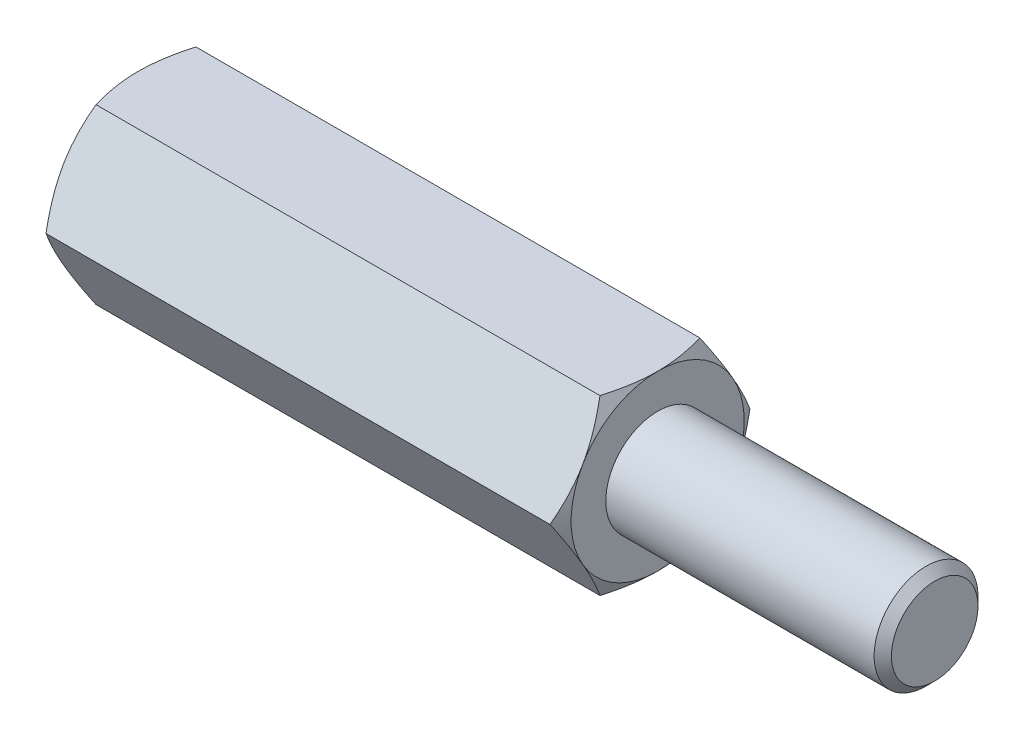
from build123d import *

# Parameters (mm, degrees)
EXTRUDE2_DEPTH = 7.5
SKETCH3_R      = 1.25
EXTRUDE3_DEPTH = 8
SKETCH5_R      = 1.5
EXTRUDE4_DEPTH = 8
CHAMFER1_SIZE  = 0.25


with BuildPart() as part:
    # Sketch1 → Extrude2 (new, symmetric)
    with BuildSketch(Plane(origin=(0, 0, 0), x_dir=(0, 0, -1), z_dir=(1, 0, 0))):
        Polygon((1.443375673, 2.5), (-1.443375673, 2.5), (-2.886751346, 0), (-1.443375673, -2.5), (1.443375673, -2.5), (2.886751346, 0), align=None)
    extrude(amount=EXTRUDE2_DEPTH, both=True)

    # Sketch2 → Cut-Revolve1 (revolve, cut)
    with BuildSketch(Plane.XY):
        with BuildLine():
            Line((-7.5, 2.5), (-6, 5.098076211))
            ThreePointArc((-6, 5.098076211), (-6.48810136, 6.276457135), (-7.5, 5.5))
            Line((-7.5, 5.5), (-7.5, 2.5))
        make_face()
    cut_revolve1 = revolve(axis=Axis((0, 0, 0), (1, 0, 0)), mode=Mode.SUBTRACT)

    # Mirror1: Cut-Revolve1 across plane
    add(cut_revolve1.mirror(Plane(origin=(0, 0, 0), x_dir=(0, 0, 1), z_dir=(1, 0, 0))), mode=Mode.SUBTRACT)

    # Sketch3 → Extrude3 (cut)
    with BuildSketch(Plane.ZY.offset(7.5)):
        Circle(SKETCH3_R)
    extrude(amount=-EXTRUDE3_DEPTH, mode=Mode.SUBTRACT)

    # Sketch4 → Cut-Revolve2 (revolve, cut)
    with BuildSketch(Plane.XY, mode=Mode.PRIVATE) as cut_revolve2_sk:
        Polygon((0.5, 0), (0.5, 1.25), (1.221687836, 0), align=None)
    revolve(cut_revolve2_sk.sketch.rotate(Axis((1.221687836, 0, 0), (-1, 0, 0)), 270), axis=Axis((1.221687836, 0, 0), (-1, 0, 0)), mode=Mode.SUBTRACT)

    # Sketch5 → Extrude4 (add)
    with BuildSketch(Plane(origin=(7.5, 0, 0), x_dir=(0, 0, -1), z_dir=(1, 0, 0))):
        Circle(SKETCH5_R)
    extrude(amount=EXTRUDE4_DEPTH)

    # Chamfer1
    chamfer1_edges = [part.edges().sort_by_distance(p)[0] for p in [
        (15.5, 0, 1.5),
    ]]
    chamfer(chamfer1_edges, length=CHAMFER1_SIZE)


solid = part.part
